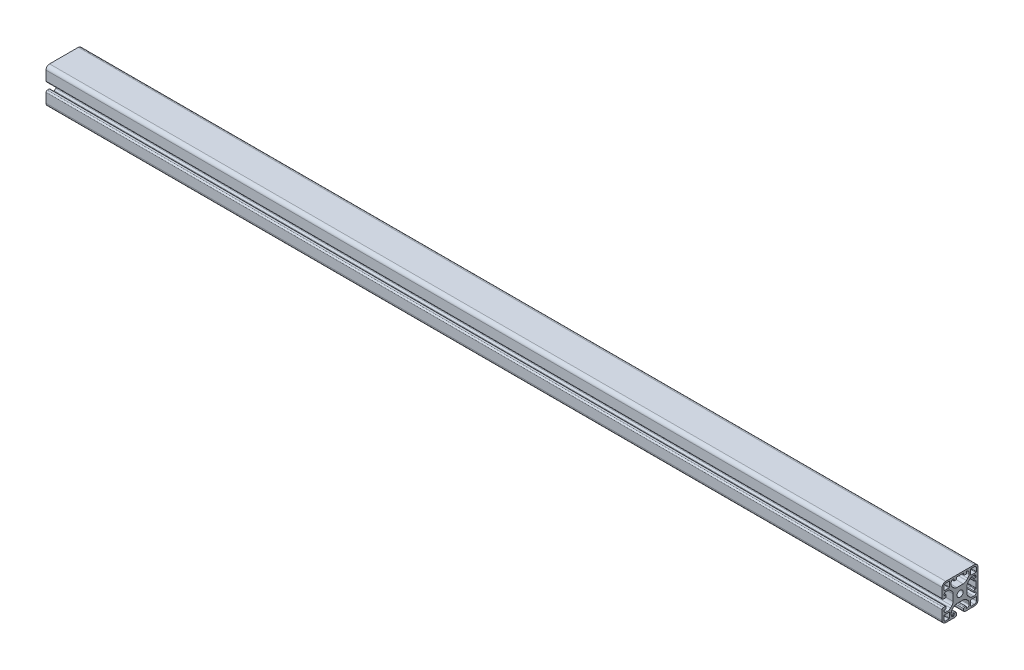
from build123d import *

# Parameters (mm, degrees)
MODEL_R                = 3.4
STRUKTURBAUTEIL1_DEPTH = 1000


with BuildPart() as part:
    # Model → Strukturbauteil1 (new body)
    with BuildSketch(Plane(origin=(0, 0, 0), x_dir=(0, 0, -1), z_dir=(1, 0, 0))):
        with BuildLine():
            Line((-20, -5.5), (-20, -16))
            ThreePointArc((-20, -16), (-18.828427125, -18.828427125), (-16, -20))
            Line((-16, -20), (-5.5, -20))
            ThreePointArc((-5.5, -20), (-4.439339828, -19.560660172), (-4, -18.5))
            Line((-4, -18.5), (-4, -16.5))
            ThreePointArc((-4, -16.5), (-4.292893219, -15.792893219), (-5, -15.5))
            Line((-5, -15.5), (-6.5, -15.5))
            ThreePointArc((-6.5, -15.5), (-6.853553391, -15.646446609), (-7, -16))
            Line((-7, -16), (-7, -17.5))
            ThreePointArc((-7, -17.5), (-7.129211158, -17.835433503), (-7.450062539, -17.9975))
            Line((-7.450062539, -17.9975), (-7.5499975, -17.9995))
            ThreePointArc((-7.5499975, -17.9995), (-9.285356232, -17.250000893), (-10, -15.5))
            Line((-10, -15.5), (-10, -14.192388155))
            ThreePointArc((-10, -14.192388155), (-9.619397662, -12.278970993), (-8.535533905, -10.656854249))
            Line((-8.535533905, -10.656854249), (-7.09314575, -9.214466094))
            ThreePointArc((-7.09314575, -9.214466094), (-5.471029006, -8.130602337), (-3.557611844, -7.75))
            Line((-3.557611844, -7.75), (3.557611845, -7.75))
            ThreePointArc((3.557611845, -7.75), (5.471029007, -8.130602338), (7.093145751, -9.214466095))
            Line((7.093145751, -9.214466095), (8.535533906, -10.65685425))
            ThreePointArc((8.535533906, -10.65685425), (9.619397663, -12.278970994), (10, -14.192388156))
            Line((10, -14.192388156), (10, -15.500000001))
            ThreePointArc((10, -15.500000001), (9.285356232, -17.250000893), (7.5499975, -17.9995))
            Line((7.5499975, -17.9995), (7.450062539, -17.9975))
            ThreePointArc((7.450062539, -17.9975), (7.129211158, -17.835433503), (7, -17.5))
            Line((7, -17.5), (7, -16))
            ThreePointArc((7, -16), (6.853553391, -15.646446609), (6.5, -15.5))
            Line((6.5, -15.5), (5, -15.5))
            ThreePointArc((5, -15.5), (4.292893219, -15.792893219), (4, -16.5))
            Line((4, -16.5), (4, -18.5))
            ThreePointArc((4, -18.5), (4.439339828, -19.560660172), (5.5, -20))
            Line((5.5, -20), (16, -20))
            ThreePointArc((16, -20), (18.828427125, -18.828427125), (20, -16))
            Line((20, -16), (20, 16))
            ThreePointArc((20, 16), (18.828427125, 18.828427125), (16, 20))
            Line((16, 20), (-16, 20))
            ThreePointArc((-16, 20), (-18.828427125, 18.828427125), (-20, 16))
            Line((-20, 16), (-20, 5.5))
            ThreePointArc((-20, 5.5), (-19.560660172, 4.439339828), (-18.5, 4))
            Line((-18.5, 4), (-16.5, 4))
            ThreePointArc((-16.5, 4), (-15.792893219, 4.292893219), (-15.5, 5))
            Line((-15.5, 5), (-15.5, 6.5))
            ThreePointArc((-15.5, 6.5), (-15.646446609, 6.853553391), (-16, 7))
            Line((-16, 7), (-17.5, 7))
            ThreePointArc((-17.5, 7), (-17.835433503, 7.129211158), (-17.9975, 7.450062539))
            Line((-17.9975, 7.450062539), (-17.9995, 7.5499975))
            ThreePointArc((-17.9995, 7.5499975), (-17.250000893, 9.285356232), (-15.5, 10))
            Line((-15.5, 10), (-14.192388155, 10))
            ThreePointArc((-14.192388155, 10), (-12.278970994, 9.619397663), (-10.656854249, 8.535533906))
            Line((-10.656854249, 8.535533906), (-9.214466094, 7.093145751))
            ThreePointArc((-9.214466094, 7.093145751), (-8.130602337, 5.471029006), (-7.75, 3.557611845))
            Line((-7.75, 3.557611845), (-7.75, -3.557611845))
            ThreePointArc((-7.75, -3.557611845), (-8.130602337, -5.471029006), (-9.214466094, -7.093145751))
            Line((-9.214466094, -7.093145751), (-10.656854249, -8.535533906))
            ThreePointArc((-10.656854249, -8.535533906), (-12.278970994, -9.619397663), (-14.192388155, -10))
            Line((-14.192388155, -10), (-15.5, -10))
            ThreePointArc((-15.5, -10), (-17.250000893, -9.285356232), (-17.9995, -7.5499975))
            Line((-17.9995, -7.5499975), (-17.9975, -7.450062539))
            ThreePointArc((-17.9975, -7.450062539), (-17.835433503, -7.129211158), (-17.5, -7))
            Line((-17.5, -7), (-16, -7))
            ThreePointArc((-16, -7), (-15.646446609, -6.853553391), (-15.5, -6.5))
            Line((-15.5, -6.5), (-15.5, -5))
            ThreePointArc((-15.5, -5), (-15.792893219, -4.292893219), (-16.5, -4))
            Line((-16.5, -4), (-18.5, -4))
            ThreePointArc((-18.5, -4), (-19.560660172, -4.439339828), (-20, -5.5))
        make_face()
        Circle(MODEL_R, mode=Mode.SUBTRACT)
        with BuildLine():
            Line((-5, 15.5), (-6.5, 15.5))
            ThreePointArc((-6.5, 15.5), (-6.853553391, 15.646446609), (-7, 16))
            Line((-7, 16), (-7, 17.5))
            ThreePointArc((-7, 17.5), (-7.129211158, 17.835433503), (-7.450062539, 17.9975))
            Line((-7.450062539, 17.9975), (-7.5499975, 17.9995))
            ThreePointArc((-7.5499975, 17.9995), (-9.285356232, 17.250000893), (-10, 15.5))
            Line((-10, 15.5), (-10, 14.192388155))
            ThreePointArc((-10, 14.192388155), (-9.619397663, 12.278970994), (-8.535533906, 10.656854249))
            Line((-8.535533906, 10.656854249), (-7.093145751, 9.214466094))
            ThreePointArc((-7.093145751, 9.214466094), (-5.471029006, 8.130602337), (-3.557611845, 7.75))
            Line((-3.557611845, 7.75), (3.557611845, 7.75))
            ThreePointArc((3.557611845, 7.75), (5.471029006, 8.130602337), (7.093145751, 9.214466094))
            Line((7.093145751, 9.214466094), (8.535533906, 10.656854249))
            ThreePointArc((8.535533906, 10.656854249), (9.619397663, 12.278970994), (10, 14.192388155))
            Line((10, 14.192388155), (10, 15.5))
            ThreePointArc((10, 15.5), (9.285356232, 17.250000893), (7.5499975, 17.9995))
            Line((7.5499975, 17.9995), (7.450062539, 17.9975))
            ThreePointArc((7.450062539, 17.9975), (7.129211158, 17.835433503), (7, 17.5))
            Line((7, 17.5), (7, 16))
            ThreePointArc((7, 16), (6.853553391, 15.646446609), (6.5, 15.5))
            Line((6.5, 15.5), (5, 15.5))
            ThreePointArc((5, 15.5), (4.292893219, 15.792893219), (4, 16.5))
            Line((4, 16.5), (4, 17.5))
            ThreePointArc((4, 17.5), (3.853553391, 17.853553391), (3.5, 18))
            Line((3.5, 18), (-3.5, 18))
            ThreePointArc((-3.5, 18), (-3.853553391, 17.853553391), (-4, 17.5))
            Line((-4, 17.5), (-4, 16.5))
            ThreePointArc((-4, 16.5), (-4.292893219, 15.792893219), (-5, 15.5))
        make_face(mode=Mode.SUBTRACT)
        with BuildLine():
            Line((11.8, 17.7), (11.8, 12.3))
            ThreePointArc((11.8, 12.3), (11.946446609, 11.946446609), (12.3, 11.8))
            Line((12.3, 11.8), (17.7, 11.8))
            ThreePointArc((17.7, 11.8), (18.053553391, 11.946446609), (18.2, 12.3))
            Line((18.2, 12.3), (18.2, 16))
            ThreePointArc((18.2, 16), (17.555634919, 17.555634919), (16, 18.2))
            Line((16, 18.2), (12.3, 18.2))
            ThreePointArc((12.3, 18.2), (11.946446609, 18.053553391), (11.8, 17.7))
        make_face(mode=Mode.SUBTRACT)
        with BuildLine():
            Line((-16, 18.2), (-12.3, 18.2))
            ThreePointArc((-12.3, 18.2), (-11.946446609, 18.053553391), (-11.8, 17.7))
            Line((-11.8, 17.7), (-11.8, 12.3))
            ThreePointArc((-11.8, 12.3), (-11.946446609, 11.946446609), (-12.3, 11.8))
            Line((-12.3, 11.8), (-17.7, 11.8))
            ThreePointArc((-17.7, 11.8), (-18.053553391, 11.946446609), (-18.2, 12.3))
            Line((-18.2, 12.3), (-18.2, 16))
            ThreePointArc((-18.2, 16), (-17.555634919, 17.555634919), (-16, 18.2))
        make_face(mode=Mode.SUBTRACT)
        with BuildLine():
            Line((-16, -18.2), (-12.3, -18.2))
            ThreePointArc((-12.3, -18.2), (-11.946446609, -18.053553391), (-11.8, -17.7))
            Line((-11.8, -17.7), (-11.8, -12.3))
            ThreePointArc((-11.8, -12.3), (-11.946446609, -11.946446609), (-12.3, -11.8))
            Line((-12.3, -11.8), (-17.7, -11.8))
            ThreePointArc((-17.7, -11.8), (-18.053553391, -11.946446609), (-18.2, -12.3))
            Line((-18.2, -12.3), (-18.2, -16))
            ThreePointArc((-18.2, -16), (-17.555634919, -17.555634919), (-16, -18.2))
        make_face(mode=Mode.SUBTRACT)
        with BuildLine():
            Line((12.3, -18.2), (16, -18.2))
            ThreePointArc((16, -18.2), (17.555634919, -17.555634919), (18.2, -16))
            Line((18.2, -16), (18.2, -12.3))
            ThreePointArc((18.2, -12.3), (18.053553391, -11.946446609), (17.7, -11.8))
            Line((17.7, -11.8), (12.3, -11.8))
            ThreePointArc((12.3, -11.8), (11.946446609, -11.946446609), (11.8, -12.3))
            Line((11.8, -12.3), (11.8, -17.7))
            ThreePointArc((11.8, -17.7), (11.946446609, -18.053553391), (12.3, -18.2))
        make_face(mode=Mode.SUBTRACT)
        with BuildLine():
            Line((15.5, 5), (15.5, 6.5))
            ThreePointArc((15.5, 6.5), (15.646446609, 6.853553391), (16, 7))
            Line((16, 7), (17.5, 7))
            ThreePointArc((17.5, 7), (17.835433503, 7.129211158), (17.9975, 7.450062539))
            Line((17.9975, 7.450062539), (17.9995, 7.5499975))
            ThreePointArc((17.9995, 7.5499975), (17.250000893, 9.285356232), (15.5, 10))
            Line((15.5, 10), (14.192388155, 10))
            ThreePointArc((14.192388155, 10), (12.278970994, 9.619397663), (10.656854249, 8.535533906))
            Line((10.656854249, 8.535533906), (9.214466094, 7.093145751))
            ThreePointArc((9.214466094, 7.093145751), (8.130602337, 5.471029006), (7.75, 3.557611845))
            Line((7.75, 3.557611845), (7.75, -3.557611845))
            ThreePointArc((7.75, -3.557611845), (8.130602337, -5.471029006), (9.214466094, -7.093145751))
            Line((9.214466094, -7.093145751), (10.656854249, -8.535533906))
            ThreePointArc((10.656854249, -8.535533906), (12.278970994, -9.619397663), (14.192388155, -10))
            Line((14.192388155, -10), (15.5, -10))
            ThreePointArc((15.5, -10), (17.250000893, -9.285356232), (17.9995, -7.5499975))
            Line((17.9995, -7.5499975), (17.9975, -7.450062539))
            ThreePointArc((17.9975, -7.450062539), (17.835433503, -7.129211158), (17.5, -7))
            Line((17.5, -7), (16, -7))
            ThreePointArc((16, -7), (15.646446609, -6.853553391), (15.5, -6.5))
            Line((15.5, -6.5), (15.5, -5))
            ThreePointArc((15.5, -5), (15.792893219, -4.292893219), (16.5, -4))
            Line((16.5, -4), (17.5, -4))
            ThreePointArc((17.5, -4), (17.853553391, -3.853553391), (18, -3.5))
            Line((18, -3.5), (18, 3.5))
            ThreePointArc((18, 3.5), (17.853553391, 3.853553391), (17.5, 4))
            Line((17.5, 4), (16.5, 4))
            ThreePointArc((16.5, 4), (15.792893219, 4.292893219), (15.5, 5))
        make_face(mode=Mode.SUBTRACT)
    extrude(amount=STRUKTURBAUTEIL1_DEPTH)


solid = part.part
